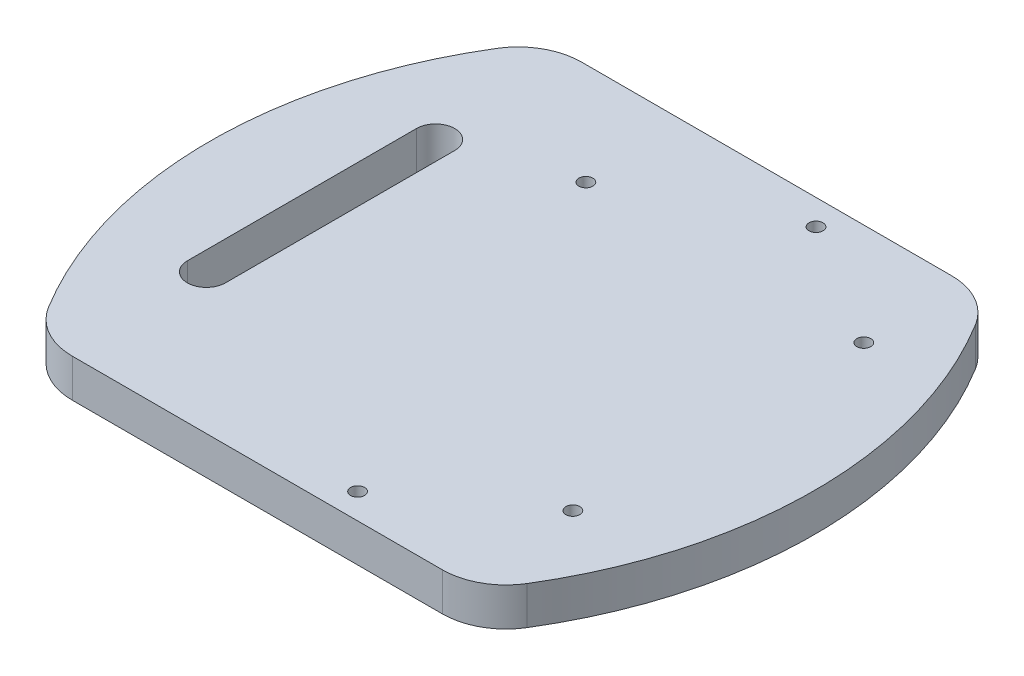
from build123d import *

# Parameters (mm, degrees)
ESQUISSE1_R      = 1.1
EXTRUSION1_DEPTH = 6


with BuildPart() as part:
    # Esquisse1 → Extrusion1 (new body)
    with BuildSketch(Plane(origin=(0, 0, 0), x_dir=(1, 0, 0), z_dir=(0, 1, 0))):
        with BuildLine():
            Line((-34.053542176, 40), (24.053542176, 40))
            ThreePointArc((24.053542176, 40), (28.943638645, 38.72278376), (32.584592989, 35.217391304))
            ThreePointArc((32.584592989, 35.217391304), (42.5, 0), (32.584592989, -35.217391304))
            ThreePointArc((32.584592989, -35.217391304), (28.943638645, -38.72278376), (24.053542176, -40))
            Line((24.053542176, -40), (-34.053542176, -40))
            ThreePointArc((-34.053542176, -40), (-38.943638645, -38.72278376), (-42.584592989, -35.217391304))
            ThreePointArc((-42.584592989, -35.217391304), (-52.5, 0), (-42.584592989, 35.217391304))
            ThreePointArc((-42.584592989, 35.217391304), (-38.943638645, 38.72278376), (-34.053542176, 40))
        make_face()
        with Locations(Location((26.26, 24, 0), (0, 0, 270))):
            Circle(ESQUISSE1_R, mode=Mode.SUBTRACT)
        with Locations(Location((-17.4, 24, 0), (0, 0, 270))):
            Circle(ESQUISSE1_R, mode=Mode.SUBTRACT)
        with Locations(Location((26.26, -21.7, 0), (0, 0, 270))):
            Circle(ESQUISSE1_R, mode=Mode.SUBTRACT)
        with Locations(Location((6.75, 36, 0), (0, 0, 270))):
            Circle(ESQUISSE1_R, mode=Mode.SUBTRACT)
        with Locations(Location((6.75, -36, 0), (0, 0, 90))):
            Circle(ESQUISSE1_R, mode=Mode.SUBTRACT)
        with BuildLine():
            Line((-38, 18), (-38, -18))
            ThreePointArc((-38, -18), (-35, -21), (-32, -18))
            Line((-32, -18), (-32, 18))
            ThreePointArc((-32, 18), (-35, 21), (-38, 18))
        make_face(mode=Mode.SUBTRACT)
    extrude(amount=EXTRUSION1_DEPTH)


solid = part.part
